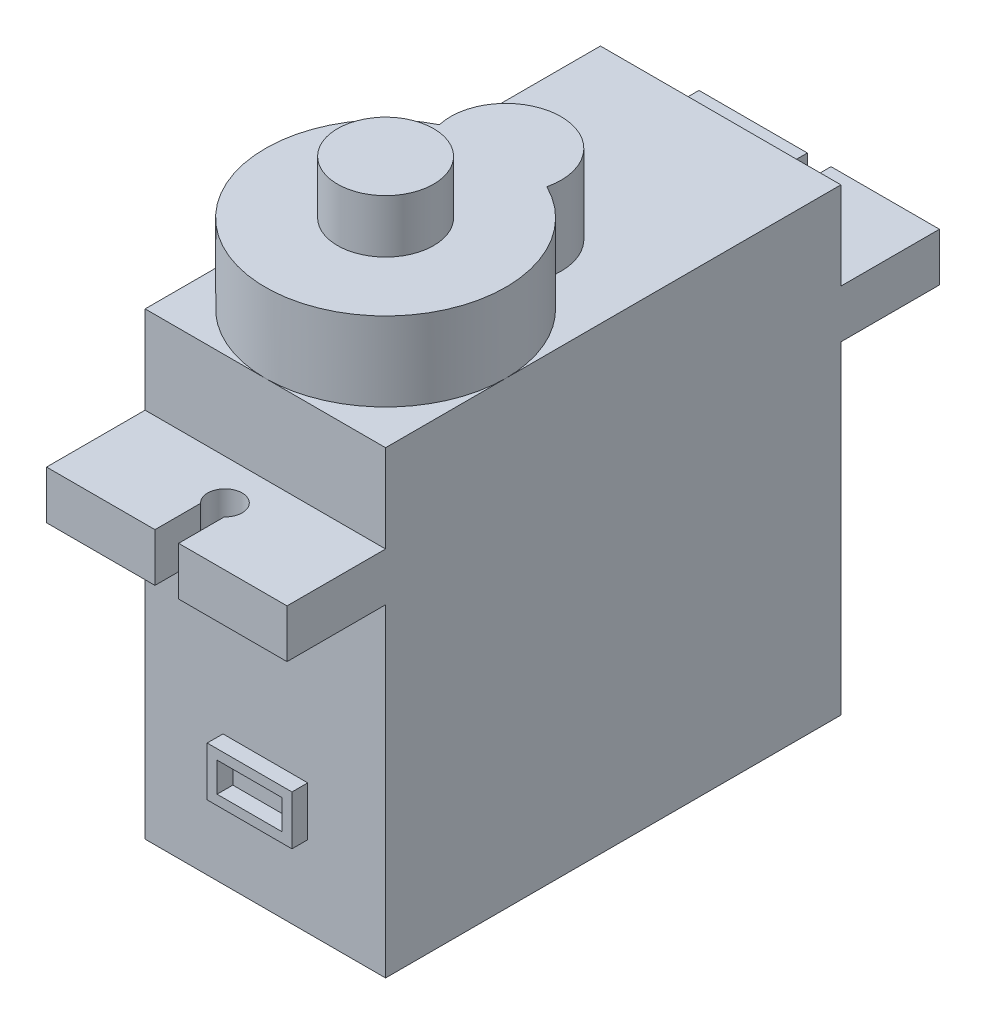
from build123d import *

# Parameters (mm, degrees)
BOSS_EXTRU_1_DEPTH      = 12.2
BOSS_EXTRU_2_DEPTH      = 4
ESQUISSE3_R             = 2.44
BOSS_EXTRU_3_DEPTH      = 2.7
ESQUISSE4_W             = 4.3
ESQUISSE4_H             = 2.5
ESQUISSE4_W_2           = 3.3
ESQUISSE4_H_2           = 1.5
BOSS_EXTRU_4_DEPTH      = 0.8
ENL_V_MAT_EXTRU_3_DEPTH = 2.5


with BuildPart() as part:
    # Esquisse1 → Boss.-Extru.1 (new body)
    with BuildSketch(Plane(origin=(0, 0, 0), x_dir=(0, 0, -1), z_dir=(1, 0, 0))):
        Polygon((23.1, 23.3), (23.1, 18.85), (28.1, 18.85), (28.1, 16.4), (23.1, 16.4), (23.1, 0), (0, 0), (0, 16.4), (-5, 16.4), (-5, 18.85), (0, 18.85), (0, 23.3), align=None)
    extrude(amount=BOSS_EXTRU_1_DEPTH)

    # Esquisse2 → Boss.-Extru.2 (add)
    with BuildSketch(Plane(origin=(0, 23.3, 0), x_dir=(1, 0, 0), z_dir=(0, 1, 0))):
        with BuildLine():
            ThreePointArc((3.37474116, 11.557377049), (6.1, 0), (8.82525884, 11.557377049))
            ThreePointArc((8.82525884, 11.557377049), (6.1, 15), (3.37474116, 11.557377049))
        make_face()
    extrude(amount=BOSS_EXTRU_2_DEPTH)

    # Esquisse3 → Boss.-Extru.3 (add)
    with BuildSketch(Plane(origin=(0, 27.3, 0), x_dir=(1, 0, 0), z_dir=(0, 1, 0))):
        with Locations(Location((6.1, 6.1, 0), (0, 0, 90))):
            Circle(ESQUISSE3_R)
    extrude(amount=BOSS_EXTRU_3_DEPTH)

    # Esquisse4 → Boss.-Extru.4 (add)
    with BuildSketch(Plane.XY):
        with Locations((6.1, 5.35)):
            Rectangle(ESQUISSE4_W, ESQUISSE4_H)
        with Locations((6.1, 5.35)):
            Rectangle(ESQUISSE4_W_2, ESQUISSE4_H_2, mode=Mode.SUBTRACT)
    extrude(amount=BOSS_EXTRU_4_DEPTH)

    # Esquisse5 → Enl_v. mat.-Extru.3 (cut)
    with BuildSketch(Plane(origin=(0, 18.85, 0), x_dir=(1, 0, 0), z_dir=(0, 1, 0))):
        with BuildLine():
            Line((5.5, -2.686545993), (5.5, -5))
            Line((5.5, -5), (6.7, -5))
            Line((6.7, -5), (6.7, -2.686545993))
            ThreePointArc((6.7, -2.686545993), (6.1, -1.175248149), (5.5, -2.686545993))
        make_face()
        with BuildLine():
            Line((5.5, 25.786545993), (5.5, 28.1))
            Line((5.5, 28.1), (6.7, 28.1))
            Line((6.7, 28.1), (6.7, 25.786545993))
            ThreePointArc((6.7, 25.786545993), (6.1, 24.1), (5.5, 25.786545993))
        make_face()
    extrude(amount=-ENL_V_MAT_EXTRU_3_DEPTH, mode=Mode.SUBTRACT)


solid = part.part
